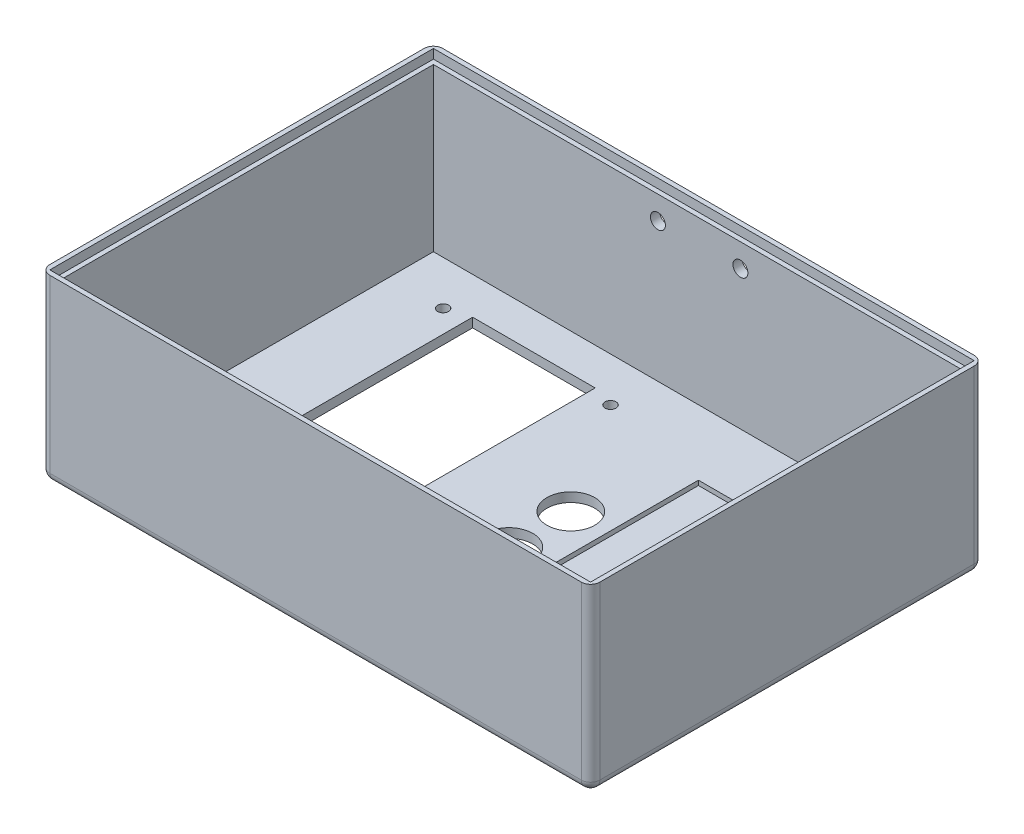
from build123d import *

# Parameters (mm, degrees)
SKETCH1_W             = 177.8
SKETCH1_H             = 127
BOSS_EXTRUDE1_DEPTH   = 58.42
SKETCH2_W             = 174.8
SKETCH2_H             = 124
CUT_EXTRUDE1_DEPTH    = 3
SKETCH3_W             = 171.8
SKETCH3_H             = 121
CUT_EXTRUDE2_DEPTH    = 52.42
SKETCH4_W             = 39.624
SKETCH4_H             = 97.028
CUT_EXTRUDE3_DEPTH    = 123.502393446
SKETCH5_W             = 58.42
SKETCH5_H             = 91.44
CUT_EXTRUDE4_DEPTH    = 1.5
M13_CLEARANCE_HOLE1_D = 15.494
M3_CLEARANCE_HOLE1_D  = 3.556
FILLET1_R             = 3
SKETCH10_R            = 2.413
CUT_EXTRUDE5_DEPTH    = 3


with BuildPart() as part:
    # Sketch1 → Boss-Extrude1 (new body)
    with BuildSketch(Plane(origin=(0, 58.42, 0), x_dir=(1, 0, 0), z_dir=(0, 1, 0))):
        Rectangle(SKETCH1_W, SKETCH1_H)
    extrude(amount=-BOSS_EXTRUDE1_DEPTH)

    # Sketch2 → Cut-Extrude1 (cut)
    with BuildSketch(Plane(origin=(0, 58.42, 0), x_dir=(-1, 0, 0), z_dir=(0, 1, 0))):
        Rectangle(SKETCH2_W, SKETCH2_H)
    extrude(amount=-CUT_EXTRUDE1_DEPTH, mode=Mode.SUBTRACT)

    # Sketch3 → Cut-Extrude2 (cut)
    with BuildSketch(Plane(origin=(0, 55.42, 0), x_dir=(-1, 0, 0), z_dir=(0, 1, 0))):
        Rectangle(SKETCH3_W, SKETCH3_H)
    extrude(amount=-CUT_EXTRUDE2_DEPTH, mode=Mode.SUBTRACT)

    # Sketch4 → Cut-Extrude3 (cut, through all)
    with BuildSketch(Plane(origin=(0, 3, 0), x_dir=(-1, 0, 0), z_dir=(0, 1, 0))):
        with Locations((41.436, 0)):
            Rectangle(SKETCH4_W, SKETCH4_H)
    extrude(amount=-CUT_EXTRUDE3_DEPTH, mode=Mode.SUBTRACT)

    # Sketch5 → Cut-Extrude4 (cut)
    with BuildSketch(Plane(origin=(0, 3, 0), x_dir=(-1, 0, 0), z_dir=(0, 1, 0))):
        with Locations((-50.081235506, 6.33173816)):
            Rectangle(SKETCH5_W, SKETCH5_H)
    extrude(amount=-CUT_EXTRUDE4_DEPTH, mode=Mode.SUBTRACT)

    # M13 Clearance Hole1 (through all)
    with Locations(Plane(origin=(0, 3, 0), x_dir=(1, 0, 0), z_dir=(0, 1, 0))):
        with Locations((8.992455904, -10.016759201), (8.992455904, 10.016759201)):
            Hole(M13_CLEARANCE_HOLE1_D / 2)

    # M3 Clearance Hole1 (through all)
    with Locations(Plane(origin=(0, 3, 0), x_dir=(1, 0, 0), z_dir=(0, 1, 0))):
        with Locations((-68.487, 46.228), (-68.487, -46.228), (-14.385, -46.228), (-14.385, 46.228)):
            Hole(M3_CLEARANCE_HOLE1_D / 2)

    # Fillet1
    fillet1_edges = [part.edges().sort_by_distance(p)[0] for p in [
        (88.9, 0, 0),
        (0, 0, -63.5),
        (-88.9, 0, 0),
        (-88.9, 29.21, -63.5),
        (88.9, 29.21, -63.5),
        (88.9, 29.21, 63.5),
        (-88.9, 29.21, 63.5),
        (0, 0, 63.5),
    ]]
    fillet(fillet1_edges, radius=FILLET1_R)

    # Sketch10 → Cut-Extrude5 (cut)
    with BuildSketch(Plane(origin=(0, 0, -63.5), x_dir=(-1, 0, 0), z_dir=(0, 0, -1))):
        with Locations((-13.335, 47.879)):
            Circle(SKETCH10_R)
        with Locations((13.335, 47.879)):
            Circle(SKETCH10_R)
    extrude(amount=-CUT_EXTRUDE5_DEPTH, mode=Mode.SUBTRACT)


solid = part.part
